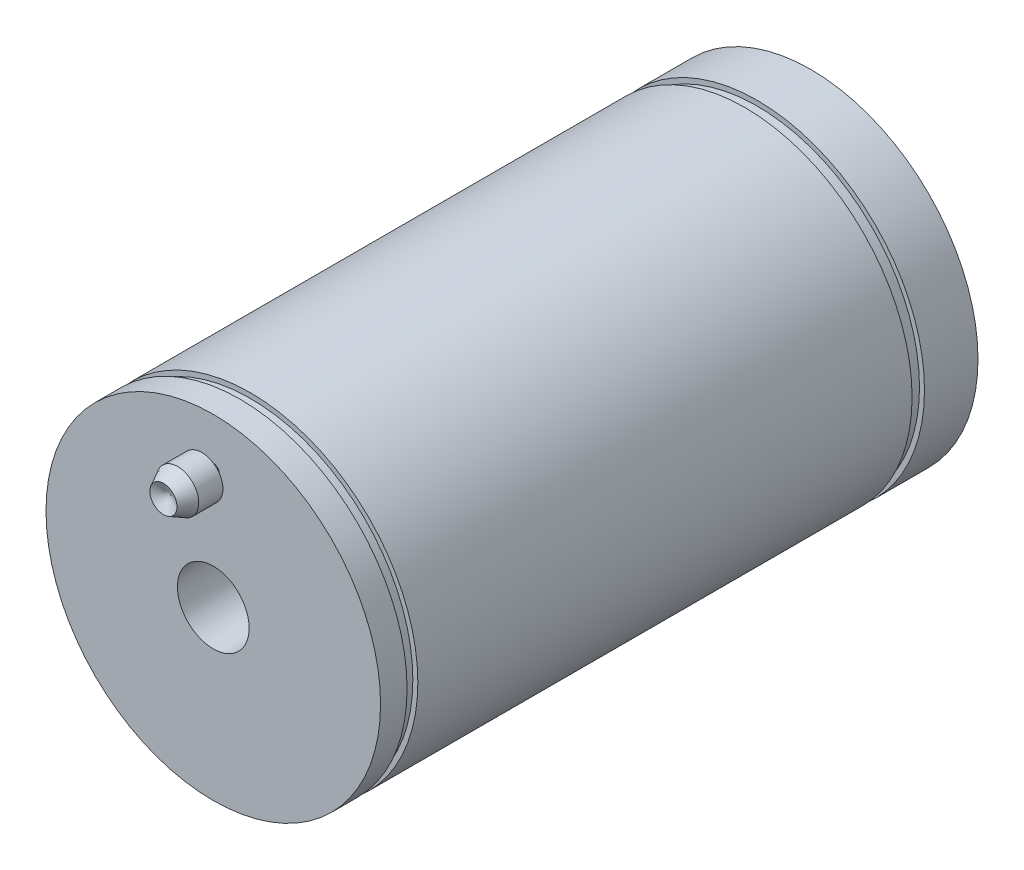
from build123d import *

# Parameters (mm, degrees)
SKETCH1_R               = 70
BOSS_EXTRUDE1_DEPTH     = 250
SKETCH2_W               = 4.508409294
SKETCH2_H               = 3.497903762
SKETCH2_W_2             = 5.184144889
CUT_EXTRUDE1_DEPTH      = 47
CUT_EXTRUDE1_DEPTH_BACK = 265
SKETCH4_R               = 15


with BuildPart() as part:
    # Sketch1 → Boss-Extrude1 (new body)
    with BuildSketch(Plane.XY):
        Circle(SKETCH1_R)
    extrude(amount=-BOSS_EXTRUDE1_DEPTH)

    # Sketch2 → Cut-Revolve1 (revolve, cut)
    with BuildSketch(Plane(origin=(0, 0, 0), x_dir=(0, 0, -1), z_dir=(1, 0, 0)), mode=Mode.PRIVATE) as cut_revolve1_sk:
        with Locations((13.343474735, 69.662126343)):
            Rectangle(SKETCH2_W, SKETCH2_H)
        with Locations((225.014204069, 69.662126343)):
            Rectangle(SKETCH2_W_2, SKETCH2_H)
    revolve(cut_revolve1_sk.sketch.rotate(Axis((0, 0, 46.547595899), (0, 0, -1)), 90), axis=Axis((0, 0, 46.547595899), (0, 0, -1)), mode=Mode.SUBTRACT)

    # Sketch3 → Revolve2 (revolve)
    with BuildSketch(Plane(origin=(0, 0, 0), x_dir=(0, 0, -1), z_dir=(1, 0, 0)), mode=Mode.PRIVATE) as revolve2_sk:
        Polygon((0, 52.294853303), (-4.768710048, 52.294853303), (-4.768710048, 58.552357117), (-14.8999067, 58.552357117), (-20.859434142, 55.42360521), (-17.879670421, 49.747864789), (0, 49.747864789), align=None)
    revolve(revolve2_sk.sketch.rotate(Axis((0, 49.747864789, 17.879670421), (0, 0, -1)), 90), axis=Axis((0, 49.747864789, 17.879670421), (0, 0, -1)))

    # Sketch4 → Cut-Extrude1 (cut, two sides: drawn at the far end of the back side and taken through both)
    with BuildSketch(Plane.XY.offset(-CUT_EXTRUDE1_DEPTH_BACK)):
        Circle(SKETCH4_R)
    extrude(amount=CUT_EXTRUDE1_DEPTH + CUT_EXTRUDE1_DEPTH_BACK, mode=Mode.SUBTRACT)


solid = part.part
